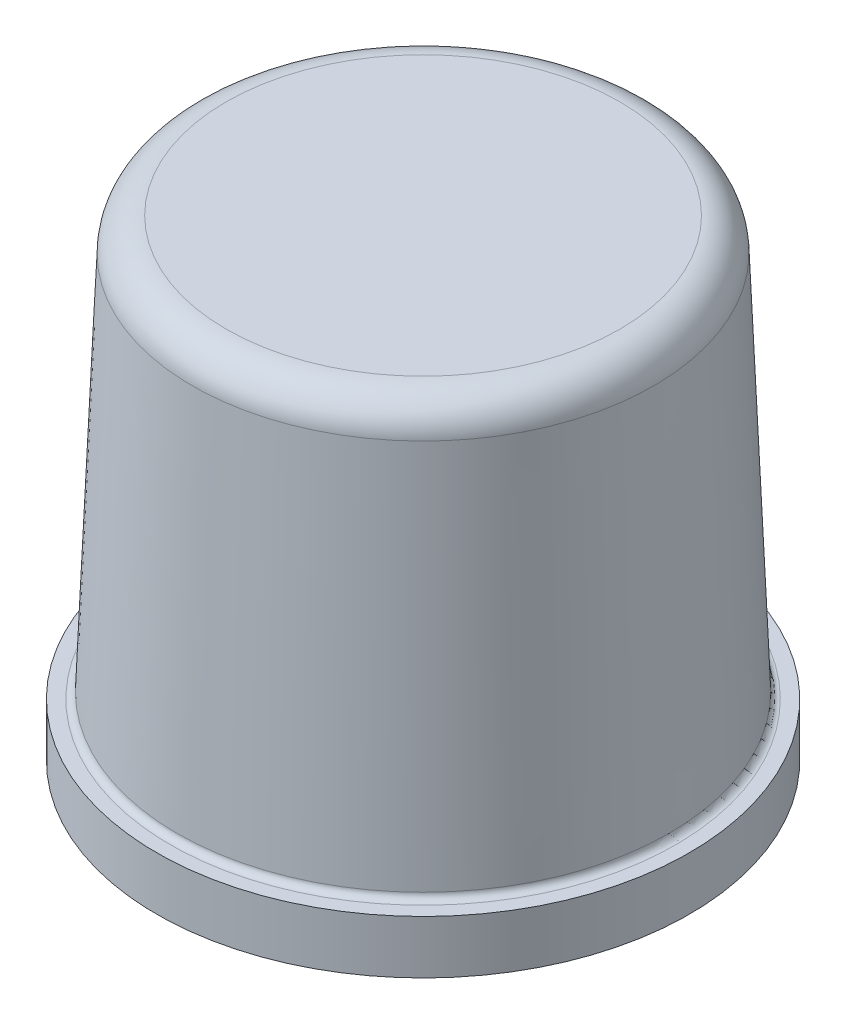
from build123d import *

# Parameters (mm, degrees)
COQUE1_T = -2


with BuildPart() as part:
    # Esquisse1 → R_volution1 (revolve)
    with BuildSketch(Plane.XY, mode=Mode.PRIVATE) as r_volution1_sk:
        with BuildLine():
            Line((0, 0), (-39.5, 0))
            Line((-39.5, 0), (-39.5, 7.9))
            Line((-39.5, 7.9), (-37.460552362, 7.9))
            ThreePointArc((-37.460552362, 7.9), (-36.767813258, 8.178811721), (-36.461361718, 8.859774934))
            Line((-36.461361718, 8.859774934), (-34.193191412, 65.201125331))
            ThreePointArc((-34.193191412, 65.201125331), (-32.660933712, 68.605941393), (-29.197238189, 70))
            Line((-29.197238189, 70), (0, 70))
            Line((0, 70), (0, 0))
        make_face()
    revolve(r_volution1_sk.sketch.rotate(Axis((0, 0, 0), (0, 1, 0)), 270), axis=Axis((0, 0, 0), (0, 1, 0)))

    # Coque1
    coque1_openings = [part.faces().sort_by_distance(p)[0] for p in [
        (0, 0, 0),
    ]]
    offset(amount=COQUE1_T, openings=coque1_openings, kind=Kind.INTERSECTION)


solid = part.part
